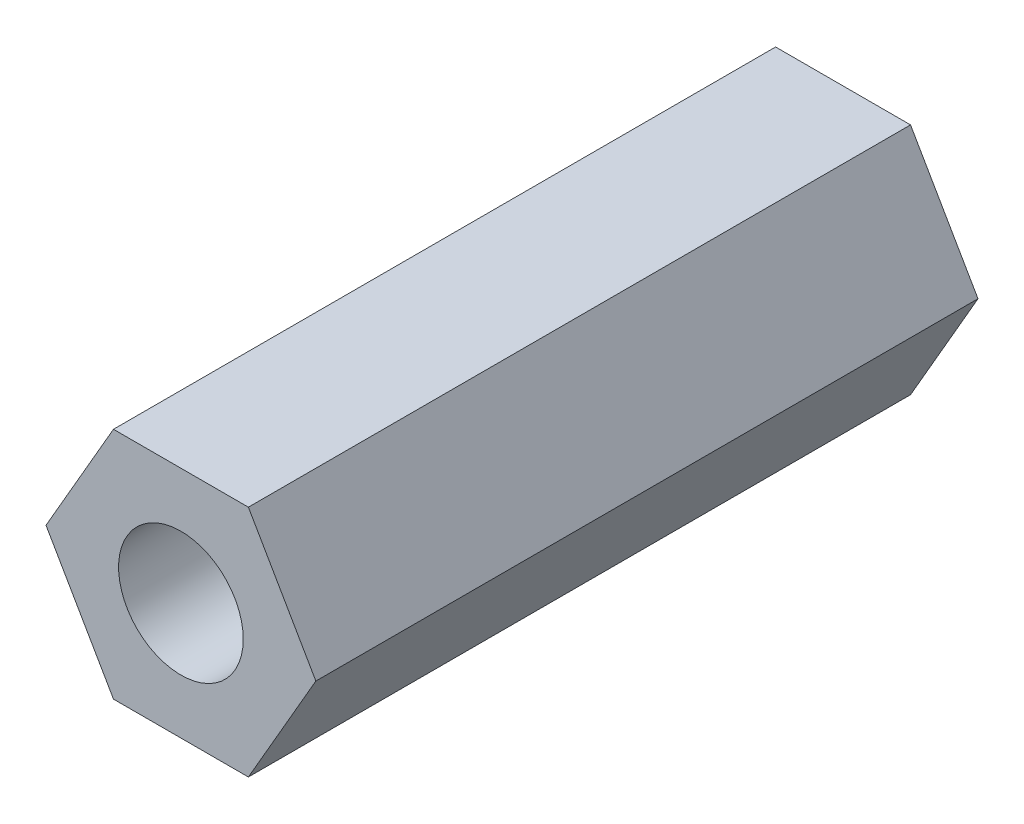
ISO-10303-21;
HEADER;
FILE_DESCRIPTION(('STEP AP214'),'2;1');
FILE_NAME('part.step','',(''),(''),'','','');
FILE_SCHEMA(('AUTOMOTIVE_DESIGN { 1 0 10303 214 1 1 1 1 }'));
ENDSEC;
DATA;
#1=APPLICATION_CONTEXT('core data for automotive mechanical design processes');
#2=APPLICATION_PROTOCOL_DEFINITION('international standard','automotive_design',2000,#1);
#3=PRODUCT_CONTEXT('',#1,'mechanical');
#4=PRODUCT('Part','Part','',(#3));
#5=PRODUCT_RELATED_PRODUCT_CATEGORY('part','',(#4));
#6=PRODUCT_DEFINITION_FORMATION('','',#4);
#7=PRODUCT_DEFINITION_CONTEXT('part definition',#1,'design');
#8=PRODUCT_DEFINITION('design','',#6,#7);
#9=PRODUCT_DEFINITION_SHAPE('','',#8);
#10=(LENGTH_UNIT() NAMED_UNIT(*) SI_UNIT(.MILLI.,.METRE.));
#11=(NAMED_UNIT(*) PLANE_ANGLE_UNIT() SI_UNIT($,.RADIAN.));
#12=(NAMED_UNIT(*) SI_UNIT($,.STERADIAN.) SOLID_ANGLE_UNIT());
#13=UNCERTAINTY_MEASURE_WITH_UNIT(LENGTH_MEASURE(1.E-05),#10,'distance_accuracy_value','');
#14=(GEOMETRIC_REPRESENTATION_CONTEXT(3) GLOBAL_UNCERTAINTY_ASSIGNED_CONTEXT((#13)) GLOBAL_UNIT_ASSIGNED_CONTEXT((#10,
#11,#12)) REPRESENTATION_CONTEXT('',''));
#15=CARTESIAN_POINT('',(0.,0.,0.));
#16=DIRECTION('',(0.,0.,1.));
#17=DIRECTION('',(1.,0.,0.));
#18=AXIS2_PLACEMENT_3D('',#15,#16,#17);
#19=CARTESIAN_POINT('',(0.,0.,17.));
#20=DIRECTION('',(0.,0.,1.));
#21=DIRECTION('',(1.,0.,0.));
#22=AXIS2_PLACEMENT_3D('',#19,#20,#21);
#23=PLANE('',#22);
#24=DIRECTION('',(-0.5,0.866025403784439,0.));
#25=VECTOR('',#24,1.);
#26=CARTESIAN_POINT('',(3.46410161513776,0.,17.));
#27=LINE('',#26,#25);
#28=CARTESIAN_POINT('',(3.46410161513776,0.,17.));
#29=VERTEX_POINT('',#28);
#30=CARTESIAN_POINT('',(1.73205080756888,3.,17.));
#31=VERTEX_POINT('',#30);
#32=EDGE_CURVE('E131',#29,#31,#27,.T.);
#33=ORIENTED_EDGE('',*,*,#32,.T.);
#34=DIRECTION('',(-1.,0.,0.));
#35=VECTOR('',#34,1.);
#36=CARTESIAN_POINT('',(1.73205080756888,3.,17.));
#37=LINE('',#36,#35);
#38=CARTESIAN_POINT('',(-1.73205080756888,3.,17.));
#39=VERTEX_POINT('',#38);
#40=EDGE_CURVE('E89',#31,#39,#37,.T.);
#41=ORIENTED_EDGE('',*,*,#40,.T.);
#42=DIRECTION('',(-0.5,-0.866025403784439,0.));
#43=VECTOR('',#42,1.);
#44=CARTESIAN_POINT('',(-1.73205080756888,3.,17.));
#45=LINE('',#44,#43);
#46=CARTESIAN_POINT('',(-3.46410161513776,0.,17.));
#47=VERTEX_POINT('',#46);
#48=EDGE_CURVE('E102',#39,#47,#45,.T.);
#49=ORIENTED_EDGE('',*,*,#48,.T.);
#50=DIRECTION('',(0.5,-0.866025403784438,0.));
#51=VECTOR('',#50,1.);
#52=CARTESIAN_POINT('',(-3.46410161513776,0.,17.));
#53=LINE('',#52,#51);
#54=CARTESIAN_POINT('',(-1.73205080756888,-3.,17.));
#55=VERTEX_POINT('',#54);
#56=EDGE_CURVE('E96',#47,#55,#53,.T.);
#57=ORIENTED_EDGE('',*,*,#56,.T.);
#58=DIRECTION('',(1.,0.,0.));
#59=VECTOR('',#58,1.);
#60=CARTESIAN_POINT('',(-1.73205080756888,-3.,17.));
#61=LINE('',#60,#59);
#62=CARTESIAN_POINT('',(1.73205080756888,-3.,17.));
#63=VERTEX_POINT('',#62);
#64=EDGE_CURVE('E100',#55,#63,#61,.T.);
#65=ORIENTED_EDGE('',*,*,#64,.T.);
#66=DIRECTION('',(0.5,0.866025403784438,0.));
#67=VECTOR('',#66,1.);
#68=CARTESIAN_POINT('',(1.73205080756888,-3.,17.));
#69=LINE('',#68,#67);
#70=EDGE_CURVE('E52',#63,#29,#69,.T.);
#71=ORIENTED_EDGE('',*,*,#70,.T.);
#72=EDGE_LOOP('',(#33,#41,#49,#57,#65,#71));
#73=FACE_BOUND('',#72,.T.);
#74=CARTESIAN_POINT('',(0.,0.,17.));
#75=DIRECTION('',(0.,0.,1.));
#76=DIRECTION('',(1.,0.,0.));
#77=AXIS2_PLACEMENT_3D('',#74,#75,#76);
#78=CIRCLE('',#77,1.6);
#79=CARTESIAN_POINT('',(1.6,0.,17.));
#80=VERTEX_POINT('',#79);
#81=EDGE_CURVE('E124',#80,#80,#78,.T.);
#82=ORIENTED_EDGE('',*,*,#81,.F.);
#83=EDGE_LOOP('',(#82));
#84=FACE_BOUND('',#83,.T.);
#85=ADVANCED_FACE('F35',(#73,#84),#23,.T.);
#86=CARTESIAN_POINT('',(0.,0.,0.));
#87=DIRECTION('',(0.,0.,1.));
#88=DIRECTION('',(1.,0.,0.));
#89=AXIS2_PLACEMENT_3D('',#86,#87,#88);
#90=PLANE('',#89);
#91=DIRECTION('',(-0.5,0.866025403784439,0.));
#92=VECTOR('',#91,1.);
#93=CARTESIAN_POINT('',(3.46410161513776,0.,0.));
#94=LINE('',#93,#92);
#95=CARTESIAN_POINT('',(3.46410161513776,0.,0.));
#96=VERTEX_POINT('',#95);
#97=CARTESIAN_POINT('',(1.73205080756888,3.,0.));
#98=VERTEX_POINT('',#97);
#99=EDGE_CURVE('E120',#96,#98,#94,.T.);
#100=ORIENTED_EDGE('',*,*,#99,.F.);
#101=DIRECTION('',(0.5,0.866025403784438,0.));
#102=VECTOR('',#101,1.);
#103=CARTESIAN_POINT('',(1.73205080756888,-3.,0.));
#104=LINE('',#103,#102);
#105=CARTESIAN_POINT('',(1.73205080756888,-3.,0.));
#106=VERTEX_POINT('',#105);
#107=EDGE_CURVE('E81',#106,#96,#104,.T.);
#108=ORIENTED_EDGE('',*,*,#107,.F.);
#109=DIRECTION('',(1.,0.,0.));
#110=VECTOR('',#109,1.);
#111=CARTESIAN_POINT('',(-1.73205080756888,-3.,0.));
#112=LINE('',#111,#110);
#113=CARTESIAN_POINT('',(-1.73205080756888,-3.,0.));
#114=VERTEX_POINT('',#113);
#115=EDGE_CURVE('E75',#114,#106,#112,.T.);
#116=ORIENTED_EDGE('',*,*,#115,.F.);
#117=DIRECTION('',(0.5,-0.866025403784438,0.));
#118=VECTOR('',#117,1.);
#119=CARTESIAN_POINT('',(-3.46410161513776,0.,0.));
#120=LINE('',#119,#118);
#121=CARTESIAN_POINT('',(-3.46410161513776,0.,0.));
#122=VERTEX_POINT('',#121);
#123=EDGE_CURVE('E110',#122,#114,#120,.T.);
#124=ORIENTED_EDGE('',*,*,#123,.F.);
#125=DIRECTION('',(-0.5,-0.866025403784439,0.));
#126=VECTOR('',#125,1.);
#127=CARTESIAN_POINT('',(-1.73205080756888,3.,0.));
#128=LINE('',#127,#126);
#129=CARTESIAN_POINT('',(-1.73205080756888,3.,0.));
#130=VERTEX_POINT('',#129);
#131=EDGE_CURVE('E126',#130,#122,#128,.T.);
#132=ORIENTED_EDGE('',*,*,#131,.F.);
#133=DIRECTION('',(-1.,0.,0.));
#134=VECTOR('',#133,1.);
#135=CARTESIAN_POINT('',(1.73205080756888,3.,0.));
#136=LINE('',#135,#134);
#137=EDGE_CURVE('E123',#98,#130,#136,.T.);
#138=ORIENTED_EDGE('',*,*,#137,.F.);
#139=EDGE_LOOP('',(#100,#108,#116,#124,#132,#138));
#140=FACE_BOUND('',#139,.T.);
#141=CARTESIAN_POINT('',(0.,0.,0.));
#142=DIRECTION('',(0.,0.,1.));
#143=DIRECTION('',(1.,0.,0.));
#144=AXIS2_PLACEMENT_3D('',#141,#142,#143);
#145=CIRCLE('',#144,1.6);
#146=CARTESIAN_POINT('',(1.6,0.,0.));
#147=VERTEX_POINT('',#146);
#148=EDGE_CURVE('E224',#147,#147,#145,.T.);
#149=ORIENTED_EDGE('',*,*,#148,.T.);
#150=EDGE_LOOP('',(#149));
#151=FACE_BOUND('',#150,.T.);
#152=ADVANCED_FACE('F140',(#140,#151),#90,.F.);
#153=CARTESIAN_POINT('',(3.46410161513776,0.,17.));
#154=DIRECTION('',(-0.866025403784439,-0.5,0.));
#155=DIRECTION('',(0.5,-0.866025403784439,0.));
#156=AXIS2_PLACEMENT_3D('',#153,#154,#155);
#157=PLANE('',#156);
#158=ORIENTED_EDGE('',*,*,#99,.T.);
#159=DIRECTION('',(0.,0.,-1.));
#160=VECTOR('',#159,1.);
#161=CARTESIAN_POINT('',(1.73205080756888,3.,17.));
#162=LINE('',#161,#160);
#163=EDGE_CURVE('E11',#31,#98,#162,.T.);
#164=ORIENTED_EDGE('',*,*,#163,.F.);
#165=ORIENTED_EDGE('',*,*,#32,.F.);
#166=DIRECTION('',(0.,0.,-1.));
#167=VECTOR('',#166,1.);
#168=CARTESIAN_POINT('',(3.46410161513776,0.,17.));
#169=LINE('',#168,#167);
#170=EDGE_CURVE('E116',#29,#96,#169,.T.);
#171=ORIENTED_EDGE('',*,*,#170,.T.);
#172=EDGE_LOOP('',(#158,#164,#165,#171));
#173=FACE_BOUND('',#172,.T.);
#174=ADVANCED_FACE('F37',(#173),#157,.F.);
#175=CARTESIAN_POINT('',(1.73205080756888,3.,17.));
#176=DIRECTION('',(0.,-1.,0.));
#177=DIRECTION('',(0.,0.,-1.));
#178=AXIS2_PLACEMENT_3D('',#175,#176,#177);
#179=PLANE('',#178);
#180=ORIENTED_EDGE('',*,*,#137,.T.);
#181=DIRECTION('',(0.,0.,-1.));
#182=VECTOR('',#181,1.);
#183=CARTESIAN_POINT('',(-1.73205080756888,3.,17.));
#184=LINE('',#183,#182);
#185=EDGE_CURVE('E44',#39,#130,#184,.T.);
#186=ORIENTED_EDGE('',*,*,#185,.F.);
#187=ORIENTED_EDGE('',*,*,#40,.F.);
#188=ORIENTED_EDGE('',*,*,#163,.T.);
#189=EDGE_LOOP('',(#180,#186,#187,#188));
#190=FACE_BOUND('',#189,.T.);
#191=ADVANCED_FACE('F165',(#190),#179,.F.);
#192=CARTESIAN_POINT('',(-1.73205080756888,3.,17.));
#193=DIRECTION('',(0.866025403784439,-0.5,0.));
#194=DIRECTION('',(0.5,0.866025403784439,0.));
#195=AXIS2_PLACEMENT_3D('',#192,#193,#194);
#196=PLANE('',#195);
#197=ORIENTED_EDGE('',*,*,#131,.T.);
#198=DIRECTION('',(0.,0.,-1.));
#199=VECTOR('',#198,1.);
#200=CARTESIAN_POINT('',(-3.46410161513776,0.,17.));
#201=LINE('',#200,#199);
#202=EDGE_CURVE('E111',#47,#122,#201,.T.);
#203=ORIENTED_EDGE('',*,*,#202,.F.);
#204=ORIENTED_EDGE('',*,*,#48,.F.);
#205=ORIENTED_EDGE('',*,*,#185,.T.);
#206=EDGE_LOOP('',(#197,#203,#204,#205));
#207=FACE_BOUND('',#206,.T.);
#208=ADVANCED_FACE('F137',(#207),#196,.F.);
#209=CARTESIAN_POINT('',(-3.46410161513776,0.,17.));
#210=DIRECTION('',(0.866025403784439,0.5,0.));
#211=DIRECTION('',(-0.5,0.866025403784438,0.));
#212=AXIS2_PLACEMENT_3D('',#209,#210,#211);
#213=PLANE('',#212);
#214=ORIENTED_EDGE('',*,*,#123,.T.);
#215=DIRECTION('',(0.,0.,-1.));
#216=VECTOR('',#215,1.);
#217=CARTESIAN_POINT('',(-1.73205080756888,-3.,17.));
#218=LINE('',#217,#216);
#219=EDGE_CURVE('E107',#55,#114,#218,.T.);
#220=ORIENTED_EDGE('',*,*,#219,.F.);
#221=ORIENTED_EDGE('',*,*,#56,.F.);
#222=ORIENTED_EDGE('',*,*,#202,.T.);
#223=EDGE_LOOP('',(#214,#220,#221,#222));
#224=FACE_BOUND('',#223,.T.);
#225=ADVANCED_FACE('F108',(#224),#213,.F.);
#226=CARTESIAN_POINT('',(-1.73205080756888,-3.,17.));
#227=DIRECTION('',(0.,1.,0.));
#228=DIRECTION('',(-1.,0.,0.));
#229=AXIS2_PLACEMENT_3D('',#226,#227,#228);
#230=PLANE('',#229);
#231=ORIENTED_EDGE('',*,*,#115,.T.);
#232=DIRECTION('',(0.,0.,-1.));
#233=VECTOR('',#232,1.);
#234=CARTESIAN_POINT('',(1.73205080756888,-3.,17.));
#235=LINE('',#234,#233);
#236=EDGE_CURVE('E112',#63,#106,#235,.T.);
#237=ORIENTED_EDGE('',*,*,#236,.F.);
#238=ORIENTED_EDGE('',*,*,#64,.F.);
#239=ORIENTED_EDGE('',*,*,#219,.T.);
#240=EDGE_LOOP('',(#231,#237,#238,#239));
#241=FACE_BOUND('',#240,.T.);
#242=ADVANCED_FACE('F114',(#241),#230,.F.);
#243=CARTESIAN_POINT('',(1.73205080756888,-3.,17.));
#244=DIRECTION('',(-0.866025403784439,0.5,0.));
#245=DIRECTION('',(-0.5,-0.866025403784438,0.));
#246=AXIS2_PLACEMENT_3D('',#243,#244,#245);
#247=PLANE('',#246);
#248=ORIENTED_EDGE('',*,*,#107,.T.);
#249=ORIENTED_EDGE('',*,*,#170,.F.);
#250=ORIENTED_EDGE('',*,*,#70,.F.);
#251=ORIENTED_EDGE('',*,*,#236,.T.);
#252=EDGE_LOOP('',(#248,#249,#250,#251));
#253=FACE_BOUND('',#252,.T.);
#254=ADVANCED_FACE('F145',(#253),#247,.F.);
#255=CARTESIAN_POINT('',(0.,0.,17.));
#256=DIRECTION('',(0.,0.,-1.));
#257=DIRECTION('',(-1.,0.,0.));
#258=AXIS2_PLACEMENT_3D('',#255,#256,#257);
#259=CYLINDRICAL_SURFACE('',#258,1.6);
#260=ORIENTED_EDGE('',*,*,#81,.T.);
#261=EDGE_LOOP('',(#260));
#262=FACE_BOUND('',#261,.T.);
#263=ORIENTED_EDGE('',*,*,#148,.F.);
#264=EDGE_LOOP('',(#263));
#265=FACE_BOUND('',#264,.T.);
#266=ADVANCED_FACE('F147',(#262,#265),#259,.F.);
#267=CLOSED_SHELL('',(#85,#152,#174,#191,#208,#225,#242,#254,#266));
#268=MANIFOLD_SOLID_BREP('B2',#267);
#269=ADVANCED_BREP_SHAPE_REPRESENTATION('',(#18,#268),#14);
#270=SHAPE_DEFINITION_REPRESENTATION(#9,#269);
ENDSEC;
END-ISO-10303-21;
